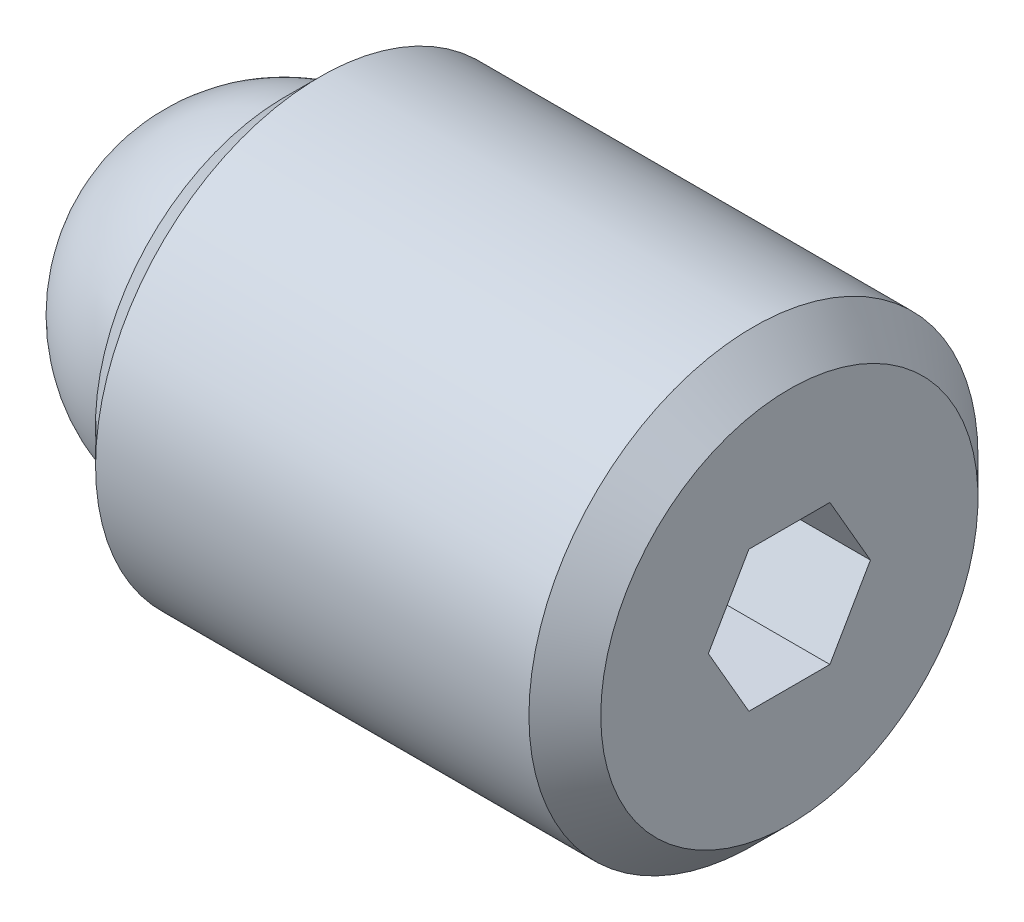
ISO-10303-21;
HEADER;
FILE_DESCRIPTION(('STEP AP214'),'2;1');
FILE_NAME('part.step','',(''),(''),'','','');
FILE_SCHEMA(('AUTOMOTIVE_DESIGN { 1 0 10303 214 1 1 1 1 }'));
ENDSEC;
DATA;
#1=APPLICATION_CONTEXT('core data for automotive mechanical design processes');
#2=APPLICATION_PROTOCOL_DEFINITION('international standard','automotive_design',2000,#1);
#3=PRODUCT_CONTEXT('',#1,'mechanical');
#4=PRODUCT('Part','Part','',(#3));
#5=PRODUCT_RELATED_PRODUCT_CATEGORY('part','',(#4));
#6=PRODUCT_DEFINITION_FORMATION('','',#4);
#7=PRODUCT_DEFINITION_CONTEXT('part definition',#1,'design');
#8=PRODUCT_DEFINITION('design','',#6,#7);
#9=PRODUCT_DEFINITION_SHAPE('','',#8);
#10=(LENGTH_UNIT() NAMED_UNIT(*) SI_UNIT(.MILLI.,.METRE.));
#11=(NAMED_UNIT(*) PLANE_ANGLE_UNIT() SI_UNIT($,.RADIAN.));
#12=(NAMED_UNIT(*) SI_UNIT($,.STERADIAN.) SOLID_ANGLE_UNIT());
#13=UNCERTAINTY_MEASURE_WITH_UNIT(LENGTH_MEASURE(1.E-05),#10,'distance_accuracy_value','');
#14=(GEOMETRIC_REPRESENTATION_CONTEXT(3) GLOBAL_UNCERTAINTY_ASSIGNED_CONTEXT((#13)) GLOBAL_UNIT_ASSIGNED_CONTEXT((#10,
#11,#12)) REPRESENTATION_CONTEXT('',''));
#15=CARTESIAN_POINT('',(0.,0.,0.));
#16=DIRECTION('',(0.,0.,1.));
#17=DIRECTION('',(1.,0.,0.));
#18=AXIS2_PLACEMENT_3D('',#15,#16,#17);
#19=CARTESIAN_POINT('',(0.,0.,0.));
#20=DIRECTION('',(0.,-1.,0.));
#21=DIRECTION('',(0.,0.,1.));
#22=AXIS2_PLACEMENT_3D('',#19,#20,#21);
#23=SPHERICAL_SURFACE('',#22,2.38125);
#24=CARTESIAN_POINT('',(0.,-2.38125,0.));
#25=VERTEX_POINT('',#24);
#26=VERTEX_LOOP('',#25);
#27=FACE_BOUND('',#26,.T.);
#28=ADVANCED_FACE('F40',(#27),#23,.T.);
#29=CLOSED_SHELL('',(#28));
#30=MANIFOLD_SOLID_BREP('B2',#29);
#31=CARTESIAN_POINT('',(7.14375,0.,0.));
#32=DIRECTION('',(-1.,0.,0.));
#33=DIRECTION('',(0.,0.,1.));
#34=AXIS2_PLACEMENT_3D('',#31,#32,#33);
#35=CYLINDRICAL_SURFACE('',#34,3.175);
#36=CARTESIAN_POINT('',(6.63575,0.,0.));
#37=DIRECTION('',(1.,0.,0.));
#38=DIRECTION('',(0.,0.,-1.));
#39=AXIS2_PLACEMENT_3D('',#36,#37,#38);
#40=CIRCLE('',#39,3.175);
#41=CARTESIAN_POINT('',(6.63575,0.,3.175));
#42=VERTEX_POINT('',#41);
#43=EDGE_CURVE('E38',#42,#42,#40,.F.);
#44=ORIENTED_EDGE('',*,*,#43,.T.);
#45=EDGE_LOOP('',(#44));
#46=FACE_BOUND('',#45,.T.);
#47=CARTESIAN_POINT('',(0.508,0.,0.));
#48=DIRECTION('',(1.,0.,0.));
#49=DIRECTION('',(0.,0.,-1.));
#50=AXIS2_PLACEMENT_3D('',#47,#48,#49);
#51=CIRCLE('',#50,3.175);
#52=CARTESIAN_POINT('',(0.508,0.,-3.175));
#53=VERTEX_POINT('',#52);
#54=EDGE_CURVE('E174',#53,#53,#51,.T.);
#55=ORIENTED_EDGE('',*,*,#54,.T.);
#56=EDGE_LOOP('',(#55));
#57=FACE_BOUND('',#56,.T.);
#58=ADVANCED_FACE('F52',(#46,#57),#35,.T.);
#59=CARTESIAN_POINT('',(7.14375,0.,0.));
#60=DIRECTION('',(1.,0.,0.));
#61=DIRECTION('',(0.,0.,-1.));
#62=AXIS2_PLACEMENT_3D('',#59,#60,#61);
#63=PLANE('',#62);
#64=DIRECTION('',(0.,0.866025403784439,-0.5));
#65=VECTOR('',#64,1.);
#66=CARTESIAN_POINT('',(7.14375,-0.9921875,-0.572839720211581));
#67=LINE('',#66,#65);
#68=CARTESIAN_POINT('',(7.14375,-0.9921875,-0.572839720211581));
#69=VERTEX_POINT('',#68);
#70=CARTESIAN_POINT('',(7.14375,0.,-1.14567944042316));
#71=VERTEX_POINT('',#70);
#72=EDGE_CURVE('E75',#69,#71,#67,.T.);
#73=ORIENTED_EDGE('',*,*,#72,.F.);
#74=DIRECTION('',(0.,0.,-1.));
#75=VECTOR('',#74,1.);
#76=CARTESIAN_POINT('',(7.14375,-0.9921875,0.572839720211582));
#77=LINE('',#76,#75);
#78=CARTESIAN_POINT('',(7.14375,-0.9921875,0.572839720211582));
#79=VERTEX_POINT('',#78);
#80=EDGE_CURVE('E141',#79,#69,#77,.T.);
#81=ORIENTED_EDGE('',*,*,#80,.F.);
#82=DIRECTION('',(0.,-0.866025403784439,-0.5));
#83=VECTOR('',#82,1.);
#84=CARTESIAN_POINT('',(7.14375,0.,1.14567944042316));
#85=LINE('',#84,#83);
#86=CARTESIAN_POINT('',(7.14375,0.,1.14567944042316));
#87=VERTEX_POINT('',#86);
#88=EDGE_CURVE('E167',#87,#79,#85,.T.);
#89=ORIENTED_EDGE('',*,*,#88,.F.);
#90=DIRECTION('',(0.,-0.866025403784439,0.5));
#91=VECTOR('',#90,1.);
#92=CARTESIAN_POINT('',(7.14375,0.992187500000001,0.572839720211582));
#93=LINE('',#92,#91);
#94=CARTESIAN_POINT('',(7.14375,0.992187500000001,0.572839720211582));
#95=VERTEX_POINT('',#94);
#96=EDGE_CURVE('E164',#95,#87,#93,.T.);
#97=ORIENTED_EDGE('',*,*,#96,.F.);
#98=DIRECTION('',(0.,0.,1.));
#99=VECTOR('',#98,1.);
#100=CARTESIAN_POINT('',(7.14375,0.9921875,-0.572839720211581));
#101=LINE('',#100,#99);
#102=CARTESIAN_POINT('',(7.14375,0.9921875,-0.572839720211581));
#103=VERTEX_POINT('',#102);
#104=EDGE_CURVE('E161',#103,#95,#101,.T.);
#105=ORIENTED_EDGE('',*,*,#104,.F.);
#106=DIRECTION('',(0.,0.866025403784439,0.5));
#107=VECTOR('',#106,1.);
#108=CARTESIAN_POINT('',(7.14375,0.,-1.14567944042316));
#109=LINE('',#108,#107);
#110=EDGE_CURVE('E158',#71,#103,#109,.T.);
#111=ORIENTED_EDGE('',*,*,#110,.F.);
#112=EDGE_LOOP('',(#73,#81,#89,#97,#105,#111));
#113=FACE_BOUND('',#112,.T.);
#114=CARTESIAN_POINT('',(7.14375,0.,0.));
#115=DIRECTION('',(1.,0.,0.));
#116=DIRECTION('',(0.,0.,-1.));
#117=AXIS2_PLACEMENT_3D('',#114,#115,#116);
#118=CIRCLE('',#117,2.667);
#119=CARTESIAN_POINT('',(7.14375,0.,2.667));
#120=VERTEX_POINT('',#119);
#121=EDGE_CURVE('E60',#120,#120,#118,.T.);
#122=ORIENTED_EDGE('',*,*,#121,.T.);
#123=EDGE_LOOP('',(#122));
#124=FACE_BOUND('',#123,.T.);
#125=ADVANCED_FACE('F191',(#113,#124),#63,.T.);
#126=CARTESIAN_POINT('',(0.,0.,0.));
#127=DIRECTION('',(1.,0.,0.));
#128=DIRECTION('',(0.,0.,-1.));
#129=AXIS2_PLACEMENT_3D('',#126,#127,#128);
#130=PLANE('',#129);
#131=CARTESIAN_POINT('',(0.,0.,0.));
#132=DIRECTION('',(-1.,0.,0.));
#133=DIRECTION('',(0.,0.,1.));
#134=AXIS2_PLACEMENT_3D('',#131,#132,#133);
#135=CIRCLE('',#134,2.38125);
#136=CARTESIAN_POINT('',(0.,2.38040333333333,-0.0634943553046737));
#137=VERTEX_POINT('',#136);
#138=CARTESIAN_POINT('',(0.,2.38040333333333,0.0634943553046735));
#139=VERTEX_POINT('',#138);
#140=EDGE_CURVE('E126',#137,#139,#135,.T.);
#141=ORIENTED_EDGE('',*,*,#140,.F.);
#142=CARTESIAN_POINT('',(0.,2.38125,0.));
#143=DIRECTION('',(-1.,0.,0.));
#144=DIRECTION('',(0.,0.,1.));
#145=AXIS2_PLACEMENT_3D('',#142,#143,#144);
#146=CIRCLE('',#145,0.0635000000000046);
#147=EDGE_CURVE('E115',#139,#137,#146,.T.);
#148=ORIENTED_EDGE('',*,*,#147,.F.);
#149=EDGE_LOOP('',(#141,#148));
#150=FACE_BOUND('',#149,.T.);
#151=CARTESIAN_POINT('',(0.,0.,0.));
#152=DIRECTION('',(1.,0.,0.));
#153=DIRECTION('',(0.,0.,-1.));
#154=AXIS2_PLACEMENT_3D('',#151,#152,#153);
#155=CIRCLE('',#154,2.667);
#156=CARTESIAN_POINT('',(0.,0.,-2.667));
#157=VERTEX_POINT('',#156);
#158=EDGE_CURVE('E186',#157,#157,#155,.F.);
#159=ORIENTED_EDGE('',*,*,#158,.T.);
#160=EDGE_LOOP('',(#159));
#161=FACE_BOUND('',#160,.T.);
#162=ADVANCED_FACE('F130',(#150,#161),#130,.F.);
#163=CARTESIAN_POINT('',(0.508,0.,0.));
#164=DIRECTION('',(1.,0.,0.));
#165=DIRECTION('',(0.,0.,-1.));
#166=AXIS2_PLACEMENT_3D('',#163,#164,#165);
#167=CONICAL_SURFACE('',#166,3.175,0.78539816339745);
#168=ORIENTED_EDGE('',*,*,#158,.F.);
#169=EDGE_LOOP('',(#168));
#170=FACE_BOUND('',#169,.T.);
#171=ORIENTED_EDGE('',*,*,#54,.F.);
#172=EDGE_LOOP('',(#171));
#173=FACE_BOUND('',#172,.T.);
#174=ADVANCED_FACE('F195',(#170,#173),#167,.T.);
#175=CARTESIAN_POINT('',(7.14375,0.,0.));
#176=DIRECTION('',(-1.,0.,0.));
#177=DIRECTION('',(0.,0.,1.));
#178=AXIS2_PLACEMENT_3D('',#175,#176,#177);
#179=CONICAL_SURFACE('',#178,2.667,0.785398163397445);
#180=CARTESIAN_POINT('',(6.63575,0.,3.175));
#181=CARTESIAN_POINT('',(6.64104166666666,0.,3.16970833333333));
#182=CARTESIAN_POINT('',(6.64633333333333,0.,3.16441666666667));
#183=CARTESIAN_POINT('',(6.65691666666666,0.,3.15383333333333));
#184=CARTESIAN_POINT('',(6.66220833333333,0.,3.14854166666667));
#185=CARTESIAN_POINT('',(6.67279166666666,0.,3.13795833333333));
#186=CARTESIAN_POINT('',(6.67808333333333,0.,3.13266666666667));
#187=CARTESIAN_POINT('',(6.68866666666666,0.,3.12208333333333));
#188=CARTESIAN_POINT('',(6.69395833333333,0.,3.11679166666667));
#189=CARTESIAN_POINT('',(6.70454166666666,0.,3.10620833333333));
#190=CARTESIAN_POINT('',(6.70983333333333,0.,3.10091666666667));
#191=CARTESIAN_POINT('',(6.72041666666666,0.,3.09033333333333));
#192=CARTESIAN_POINT('',(6.72570833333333,0.,3.08504166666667));
#193=CARTESIAN_POINT('',(6.73629166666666,0.,3.07445833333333));
#194=CARTESIAN_POINT('',(6.74158333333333,0.,3.06916666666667));
#195=CARTESIAN_POINT('',(6.75216666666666,0.,3.05858333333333));
#196=CARTESIAN_POINT('',(6.75745833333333,0.,3.05329166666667));
#197=CARTESIAN_POINT('',(6.76804166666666,0.,3.04270833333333));
#198=CARTESIAN_POINT('',(6.77333333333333,0.,3.03741666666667));
#199=CARTESIAN_POINT('',(6.78391666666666,0.,3.02683333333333));
#200=CARTESIAN_POINT('',(6.78920833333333,0.,3.02154166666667));
#201=CARTESIAN_POINT('',(6.79979166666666,0.,3.01095833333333));
#202=CARTESIAN_POINT('',(6.80508333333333,0.,3.00566666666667));
#203=CARTESIAN_POINT('',(6.81566666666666,0.,2.99508333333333));
#204=CARTESIAN_POINT('',(6.82095833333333,0.,2.98979166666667));
#205=CARTESIAN_POINT('',(6.83154166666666,0.,2.97920833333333));
#206=CARTESIAN_POINT('',(6.83683333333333,0.,2.97391666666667));
#207=CARTESIAN_POINT('',(6.84741666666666,0.,2.96333333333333));
#208=CARTESIAN_POINT('',(6.85270833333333,0.,2.95804166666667));
#209=CARTESIAN_POINT('',(6.86329166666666,0.,2.94745833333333));
#210=CARTESIAN_POINT('',(6.86858333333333,0.,2.94216666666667));
#211=CARTESIAN_POINT('',(6.87916666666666,0.,2.93158333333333));
#212=CARTESIAN_POINT('',(6.88445833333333,0.,2.92629166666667));
#213=CARTESIAN_POINT('',(6.89504166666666,0.,2.91570833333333));
#214=CARTESIAN_POINT('',(6.90033333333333,0.,2.91041666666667));
#215=CARTESIAN_POINT('',(6.91091666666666,0.,2.89983333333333));
#216=CARTESIAN_POINT('',(6.91620833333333,0.,2.89454166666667));
#217=CARTESIAN_POINT('',(6.92679166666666,0.,2.88395833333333));
#218=CARTESIAN_POINT('',(6.93208333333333,0.,2.87866666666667));
#219=CARTESIAN_POINT('',(6.94266666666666,0.,2.86808333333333));
#220=CARTESIAN_POINT('',(6.94795833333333,0.,2.86279166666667));
#221=CARTESIAN_POINT('',(6.95854166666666,0.,2.85220833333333));
#222=CARTESIAN_POINT('',(6.96383333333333,0.,2.84691666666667));
#223=CARTESIAN_POINT('',(6.97441666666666,0.,2.83633333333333));
#224=CARTESIAN_POINT('',(6.97970833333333,0.,2.83104166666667));
#225=CARTESIAN_POINT('',(6.99029166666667,0.,2.82045833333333));
#226=CARTESIAN_POINT('',(6.99558333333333,0.,2.81516666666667));
#227=CARTESIAN_POINT('',(7.00616666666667,0.,2.80458333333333));
#228=CARTESIAN_POINT('',(7.01145833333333,0.,2.79929166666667));
#229=CARTESIAN_POINT('',(7.02204166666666,0.,2.78870833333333));
#230=CARTESIAN_POINT('',(7.02733333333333,0.,2.78341666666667));
#231=CARTESIAN_POINT('',(7.03791666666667,0.,2.77283333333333));
#232=CARTESIAN_POINT('',(7.04320833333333,0.,2.76754166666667));
#233=CARTESIAN_POINT('',(7.05379166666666,0.,2.75695833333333));
#234=CARTESIAN_POINT('',(7.05908333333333,0.,2.75166666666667));
#235=CARTESIAN_POINT('',(7.06966666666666,0.,2.74108333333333));
#236=CARTESIAN_POINT('',(7.07495833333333,0.,2.73579166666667));
#237=CARTESIAN_POINT('',(7.08554166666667,0.,2.72520833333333));
#238=CARTESIAN_POINT('',(7.09083333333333,0.,2.71991666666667));
#239=CARTESIAN_POINT('',(7.10141666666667,0.,2.70933333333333));
#240=CARTESIAN_POINT('',(7.10670833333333,0.,2.70404166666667));
#241=CARTESIAN_POINT('',(7.11729166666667,0.,2.69345833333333));
#242=CARTESIAN_POINT('',(7.12258333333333,0.,2.68816666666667));
#243=CARTESIAN_POINT('',(7.13316666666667,0.,2.67758333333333));
#244=CARTESIAN_POINT('',(7.13845833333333,0.,2.67229166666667));
#245=CARTESIAN_POINT('',(7.14375,0.,2.667));
#246=B_SPLINE_CURVE_WITH_KNOTS('',3,(#180,#181,#182,#183,#184,#185,#186,#187,#188,#189,#190,
#191,#192,#193,#194,#195,#196,#197,#198,#199,#200,#201,#202,#203,#204,#205,#206,#207,#208,#209,
#210,#211,#212,#213,#214,#215,#216,#217,#218,#219,#220,#221,#222,#223,#224,#225,#226,#227,#228,
#229,#230,#231,#232,#233,#234,#235,#236,#237,#238,#239,#240,#241,#242,#243,#244,#245),
.UNSPECIFIED.,.F.,.F.,(4,2,2,2,2,2,2,2,2,2,2,2,2,2,2,2,2,2,2,2,2,2,2,2,2,2,2,2,2,2,2,2,4),(0.,
0.0224506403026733,0.0449012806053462,0.0673519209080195,0.0898025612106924,0.112253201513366,
0.134703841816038,0.157154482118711,0.179605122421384,0.202055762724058,0.22450640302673,
0.246957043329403,0.269407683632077,0.291858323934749,0.314308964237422,0.336759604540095,
0.359210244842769,0.381660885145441,0.404111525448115,0.426562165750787,0.44901280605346,
0.471463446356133,0.493914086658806,0.51636472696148,0.538815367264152,0.561266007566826,
0.583716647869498,0.606167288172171,0.628617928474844,0.651068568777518,0.67351920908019,
0.695969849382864,0.718420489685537),.UNSPECIFIED.);
#247=EDGE_CURVE('BSEAM54',#42,#120,#246,.T.);
#248=ORIENTED_EDGE('',*,*,#43,.F.);
#249=ORIENTED_EDGE('',*,*,#121,.F.);
#250=ORIENTED_EDGE('',*,*,#247,.T.);
#251=ORIENTED_EDGE('',*,*,#247,.F.);
#252=EDGE_LOOP('',(#248,#250,#249,#251));
#253=FACE_BOUND('',#252,.T.);
#254=ADVANCED_FACE('F54',(#253),#179,.T.);
#255=CARTESIAN_POINT('',(4.85775,-0.9921875,-0.572839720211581));
#256=DIRECTION('',(0.,-0.5,-0.866025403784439));
#257=DIRECTION('',(0.,0.866025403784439,-0.5));
#258=AXIS2_PLACEMENT_3D('',#255,#256,#257);
#259=PLANE('',#258);
#260=ORIENTED_EDGE('',*,*,#72,.T.);
#261=DIRECTION('',(1.,0.,0.));
#262=VECTOR('',#261,1.);
#263=CARTESIAN_POINT('',(4.85775,0.,-1.14567944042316));
#264=LINE('',#263,#262);
#265=CARTESIAN_POINT('',(4.85775,0.,-1.14567944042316));
#266=VERTEX_POINT('',#265);
#267=EDGE_CURVE('E156',#266,#71,#264,.T.);
#268=ORIENTED_EDGE('',*,*,#267,.F.);
#269=DIRECTION('',(0.,0.866025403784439,-0.5));
#270=VECTOR('',#269,1.);
#271=CARTESIAN_POINT('',(4.85775,-0.9921875,-0.572839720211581));
#272=LINE('',#271,#270);
#273=CARTESIAN_POINT('',(4.85775,-0.9921875,-0.572839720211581));
#274=VERTEX_POINT('',#273);
#275=EDGE_CURVE('E137',#274,#266,#272,.T.);
#276=ORIENTED_EDGE('',*,*,#275,.F.);
#277=DIRECTION('',(1.,0.,0.));
#278=VECTOR('',#277,1.);
#279=CARTESIAN_POINT('',(4.85775,-0.9921875,-0.572839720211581));
#280=LINE('',#279,#278);
#281=EDGE_CURVE('E172',#274,#69,#280,.T.);
#282=ORIENTED_EDGE('',*,*,#281,.T.);
#283=EDGE_LOOP('',(#260,#268,#276,#282));
#284=FACE_BOUND('',#283,.T.);
#285=ADVANCED_FACE('F194',(#284),#259,.F.);
#286=CARTESIAN_POINT('',(4.85775,-0.9921875,0.572839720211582));
#287=DIRECTION('',(0.,-1.,0.));
#288=DIRECTION('',(0.,0.,-1.));
#289=AXIS2_PLACEMENT_3D('',#286,#287,#288);
#290=PLANE('',#289);
#291=ORIENTED_EDGE('',*,*,#80,.T.);
#292=ORIENTED_EDGE('',*,*,#281,.F.);
#293=DIRECTION('',(0.,0.,-1.));
#294=VECTOR('',#293,1.);
#295=CARTESIAN_POINT('',(4.85775,-0.9921875,0.572839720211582));
#296=LINE('',#295,#294);
#297=CARTESIAN_POINT('',(4.85775,-0.9921875,0.572839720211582));
#298=VERTEX_POINT('',#297);
#299=EDGE_CURVE('E153',#298,#274,#296,.T.);
#300=ORIENTED_EDGE('',*,*,#299,.F.);
#301=DIRECTION('',(1.,0.,0.));
#302=VECTOR('',#301,1.);
#303=CARTESIAN_POINT('',(4.85775,-0.9921875,0.572839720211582));
#304=LINE('',#303,#302);
#305=EDGE_CURVE('E175',#298,#79,#304,.T.);
#306=ORIENTED_EDGE('',*,*,#305,.T.);
#307=EDGE_LOOP('',(#291,#292,#300,#306));
#308=FACE_BOUND('',#307,.T.);
#309=ADVANCED_FACE('F201',(#308),#290,.F.);
#310=CARTESIAN_POINT('',(4.85775,0.,1.14567944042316));
#311=DIRECTION('',(0.,-0.5,0.866025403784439));
#312=DIRECTION('',(0.,-0.866025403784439,-0.5));
#313=AXIS2_PLACEMENT_3D('',#310,#311,#312);
#314=PLANE('',#313);
#315=ORIENTED_EDGE('',*,*,#88,.T.);
#316=ORIENTED_EDGE('',*,*,#305,.F.);
#317=DIRECTION('',(0.,-0.866025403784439,-0.5));
#318=VECTOR('',#317,1.);
#319=CARTESIAN_POINT('',(4.85775,0.,1.14567944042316));
#320=LINE('',#319,#318);
#321=CARTESIAN_POINT('',(4.85775,0.,1.14567944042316));
#322=VERTEX_POINT('',#321);
#323=EDGE_CURVE('E150',#322,#298,#320,.T.);
#324=ORIENTED_EDGE('',*,*,#323,.F.);
#325=DIRECTION('',(1.,0.,0.));
#326=VECTOR('',#325,1.);
#327=CARTESIAN_POINT('',(4.85775,0.,1.14567944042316));
#328=LINE('',#327,#326);
#329=EDGE_CURVE('E177',#322,#87,#328,.T.);
#330=ORIENTED_EDGE('',*,*,#329,.T.);
#331=EDGE_LOOP('',(#315,#316,#324,#330));
#332=FACE_BOUND('',#331,.T.);
#333=ADVANCED_FACE('F229',(#332),#314,.F.);
#334=CARTESIAN_POINT('',(4.85775,0.992187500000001,0.572839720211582));
#335=DIRECTION('',(0.,0.5,0.866025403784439));
#336=DIRECTION('',(0.,-0.866025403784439,0.5));
#337=AXIS2_PLACEMENT_3D('',#334,#335,#336);
#338=PLANE('',#337);
#339=ORIENTED_EDGE('',*,*,#96,.T.);
#340=ORIENTED_EDGE('',*,*,#329,.F.);
#341=DIRECTION('',(0.,-0.866025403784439,0.5));
#342=VECTOR('',#341,1.);
#343=CARTESIAN_POINT('',(4.85775,0.992187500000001,0.572839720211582));
#344=LINE('',#343,#342);
#345=CARTESIAN_POINT('',(4.85775,0.992187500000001,0.572839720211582));
#346=VERTEX_POINT('',#345);
#347=EDGE_CURVE('E147',#346,#322,#344,.T.);
#348=ORIENTED_EDGE('',*,*,#347,.F.);
#349=DIRECTION('',(1.,0.,0.));
#350=VECTOR('',#349,1.);
#351=CARTESIAN_POINT('',(4.85775,0.992187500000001,0.572839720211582));
#352=LINE('',#351,#350);
#353=EDGE_CURVE('E179',#346,#95,#352,.T.);
#354=ORIENTED_EDGE('',*,*,#353,.T.);
#355=EDGE_LOOP('',(#339,#340,#348,#354));
#356=FACE_BOUND('',#355,.T.);
#357=ADVANCED_FACE('F225',(#356),#338,.F.);
#358=CARTESIAN_POINT('',(4.85775,0.9921875,-0.572839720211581));
#359=DIRECTION('',(0.,1.,0.));
#360=DIRECTION('',(0.,0.,1.));
#361=AXIS2_PLACEMENT_3D('',#358,#359,#360);
#362=PLANE('',#361);
#363=ORIENTED_EDGE('',*,*,#104,.T.);
#364=ORIENTED_EDGE('',*,*,#353,.F.);
#365=DIRECTION('',(0.,0.,1.));
#366=VECTOR('',#365,1.);
#367=CARTESIAN_POINT('',(4.85775,0.9921875,-0.572839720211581));
#368=LINE('',#367,#366);
#369=CARTESIAN_POINT('',(4.85775,0.9921875,-0.572839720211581));
#370=VERTEX_POINT('',#369);
#371=EDGE_CURVE('E144',#370,#346,#368,.T.);
#372=ORIENTED_EDGE('',*,*,#371,.F.);
#373=DIRECTION('',(1.,0.,0.));
#374=VECTOR('',#373,1.);
#375=CARTESIAN_POINT('',(4.85775,0.9921875,-0.572839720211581));
#376=LINE('',#375,#374);
#377=EDGE_CURVE('E181',#370,#103,#376,.T.);
#378=ORIENTED_EDGE('',*,*,#377,.T.);
#379=EDGE_LOOP('',(#363,#364,#372,#378));
#380=FACE_BOUND('',#379,.T.);
#381=ADVANCED_FACE('F221',(#380),#362,.F.);
#382=CARTESIAN_POINT('',(4.85775,0.,-1.14567944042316));
#383=DIRECTION('',(0.,0.5,-0.866025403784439));
#384=DIRECTION('',(0.,0.866025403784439,0.5));
#385=AXIS2_PLACEMENT_3D('',#382,#383,#384);
#386=PLANE('',#385);
#387=ORIENTED_EDGE('',*,*,#110,.T.);
#388=ORIENTED_EDGE('',*,*,#377,.F.);
#389=DIRECTION('',(0.,0.866025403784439,0.5));
#390=VECTOR('',#389,1.);
#391=CARTESIAN_POINT('',(4.85775,0.,-1.14567944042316));
#392=LINE('',#391,#390);
#393=EDGE_CURVE('E140',#266,#370,#392,.T.);
#394=ORIENTED_EDGE('',*,*,#393,.F.);
#395=ORIENTED_EDGE('',*,*,#267,.T.);
#396=EDGE_LOOP('',(#387,#388,#394,#395));
#397=FACE_BOUND('',#396,.T.);
#398=ADVANCED_FACE('F217',(#397),#386,.F.);
#399=CARTESIAN_POINT('',(4.85775,0.,0.));
#400=DIRECTION('',(1.,0.,0.));
#401=DIRECTION('',(0.,0.,-1.));
#402=AXIS2_PLACEMENT_3D('',#399,#400,#401);
#403=PLANE('',#402);
#404=ORIENTED_EDGE('',*,*,#275,.T.);
#405=ORIENTED_EDGE('',*,*,#393,.T.);
#406=ORIENTED_EDGE('',*,*,#371,.T.);
#407=ORIENTED_EDGE('',*,*,#347,.T.);
#408=ORIENTED_EDGE('',*,*,#323,.T.);
#409=ORIENTED_EDGE('',*,*,#299,.T.);
#410=EDGE_LOOP('',(#404,#405,#406,#407,#408,#409));
#411=FACE_BOUND('',#410,.T.);
#412=ADVANCED_FACE('F220',(#411),#403,.T.);
#413=CARTESIAN_POINT('',(2.38125,0.,0.));
#414=DIRECTION('',(-1.,0.,0.));
#415=DIRECTION('',(0.,0.,1.));
#416=AXIS2_PLACEMENT_3D('',#413,#414,#415);
#417=CYLINDRICAL_SURFACE('',#416,2.38125);
#418=CARTESIAN_POINT('',(2.38125,0.,0.));
#419=DIRECTION('',(-1.,0.,0.));
#420=DIRECTION('',(0.,0.,1.));
#421=AXIS2_PLACEMENT_3D('',#418,#419,#420);
#422=CIRCLE('',#421,2.38125);
#423=CARTESIAN_POINT('',(2.38125,2.38040333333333,-0.0634943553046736));
#424=VERTEX_POINT('',#423);
#425=CARTESIAN_POINT('',(2.38125,2.38040333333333,0.0634943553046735));
#426=VERTEX_POINT('',#425);
#427=EDGE_CURVE('E128',#424,#426,#422,.T.);
#428=ORIENTED_EDGE('',*,*,#427,.F.);
#429=DIRECTION('',(-1.,0.,0.));
#430=VECTOR('',#429,1.);
#431=CARTESIAN_POINT('',(2.52362097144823,2.38040333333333,-0.0634943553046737));
#432=LINE('',#431,#430);
#433=EDGE_CURVE('E67',#424,#137,#432,.T.);
#434=ORIENTED_EDGE('',*,*,#433,.T.);
#435=ORIENTED_EDGE('',*,*,#140,.T.);
#436=DIRECTION('',(-1.,0.,0.));
#437=VECTOR('',#436,1.);
#438=CARTESIAN_POINT('',(2.52362097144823,2.38040333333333,0.0634943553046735));
#439=LINE('',#438,#437);
#440=EDGE_CURVE('E118',#426,#139,#439,.T.);
#441=ORIENTED_EDGE('',*,*,#440,.F.);
#442=EDGE_LOOP('',(#428,#434,#435,#441));
#443=FACE_BOUND('',#442,.T.);
#444=ADVANCED_FACE('F125',(#443),#417,.F.);
#445=CARTESIAN_POINT('',(2.38125,0.,0.));
#446=DIRECTION('',(-1.,0.,0.));
#447=DIRECTION('',(0.,0.,1.));
#448=AXIS2_PLACEMENT_3D('',#445,#446,#447);
#449=PLANE('',#448);
#450=ORIENTED_EDGE('',*,*,#427,.T.);
#451=CARTESIAN_POINT('',(2.38125,2.38125,0.));
#452=DIRECTION('',(-1.,0.,0.));
#453=DIRECTION('',(0.,0.,1.));
#454=AXIS2_PLACEMENT_3D('',#451,#452,#453);
#455=CIRCLE('',#454,0.0635000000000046);
#456=EDGE_CURVE('E132',#424,#426,#455,.F.);
#457=ORIENTED_EDGE('',*,*,#456,.F.);
#458=EDGE_LOOP('',(#450,#457));
#459=FACE_BOUND('',#458,.T.);
#460=ADVANCED_FACE('F242',(#459),#449,.T.);
#461=CARTESIAN_POINT('',(2.52362097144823,2.38125,0.));
#462=DIRECTION('',(-1.,0.,0.));
#463=DIRECTION('',(0.,0.,1.));
#464=AXIS2_PLACEMENT_3D('',#461,#462,#463);
#465=CYLINDRICAL_SURFACE('',#464,0.0635000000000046);
#466=ORIENTED_EDGE('',*,*,#456,.T.);
#467=ORIENTED_EDGE('',*,*,#440,.T.);
#468=ORIENTED_EDGE('',*,*,#147,.T.);
#469=ORIENTED_EDGE('',*,*,#433,.F.);
#470=EDGE_LOOP('',(#466,#467,#468,#469));
#471=FACE_BOUND('',#470,.T.);
#472=ADVANCED_FACE('F116',(#471),#465,.F.);
#473=CLOSED_SHELL('',(#58,#125,#162,#174,#254,#285,#309,#333,#357,#381,#398,#412,#444,#460,#472));
#474=MANIFOLD_SOLID_BREP('B6',#473);
#475=ADVANCED_BREP_SHAPE_REPRESENTATION('',(#18,#30,#474),#14);
#476=SHAPE_DEFINITION_REPRESENTATION(#9,#475);
ENDSEC;
END-ISO-10303-21;
